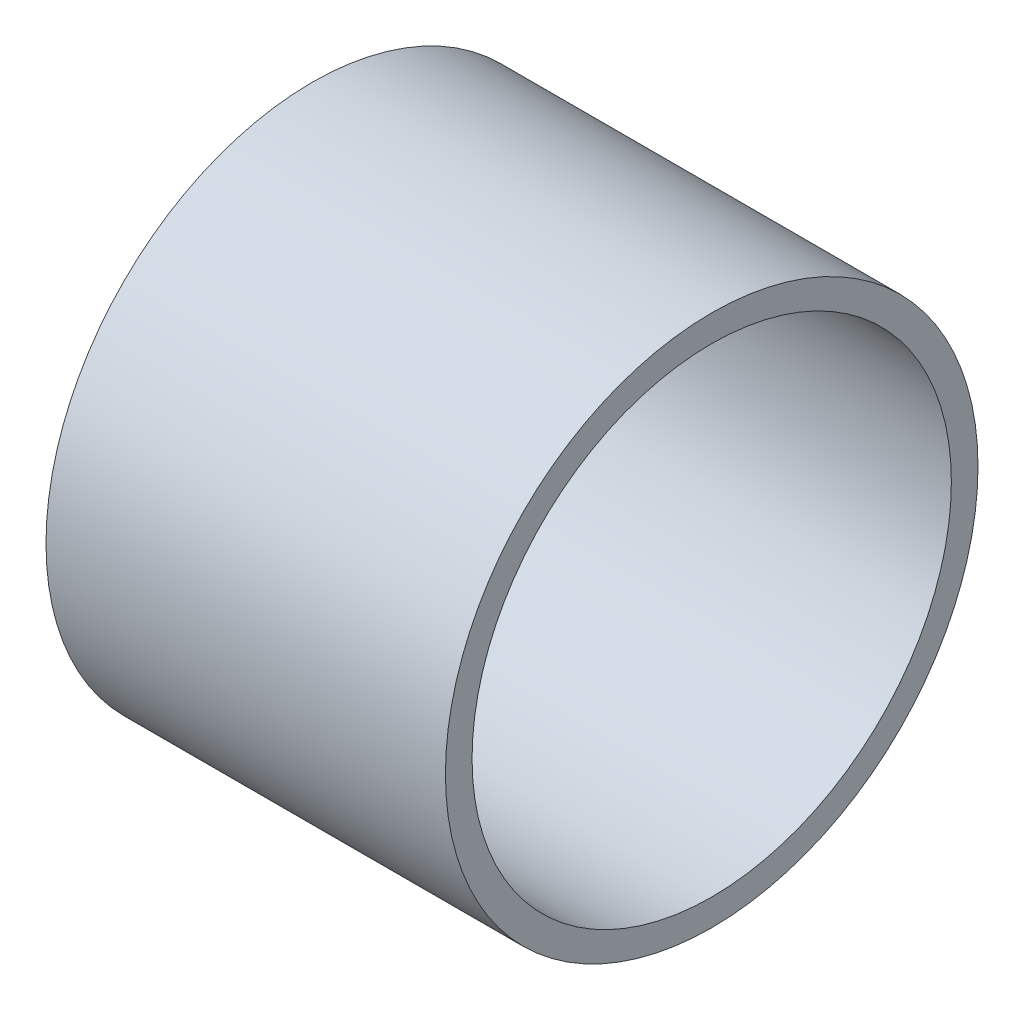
from build123d import *

# Parameters (mm, degrees)
ESQUISSE1_W = 60
ESQUISSE1_H = 4


with BuildPart() as part:
    # Esquisse1 → R_volution1 (revolve)
    with BuildSketch(Plane(origin=(0, 0, 0), x_dir=(-1, 0, 0), z_dir=(0, 0, -1)), mode=Mode.PRIVATE) as r_volution1_sk:
        with Locations((-30, 38)):
            Rectangle(ESQUISSE1_W, ESQUISSE1_H)
    revolve(r_volution1_sk.sketch.rotate(Axis((60, 0, 0), (-1, 0, 0)), 270), axis=Axis((60, 0, 0), (-1, 0, 0)))


solid = part.part
